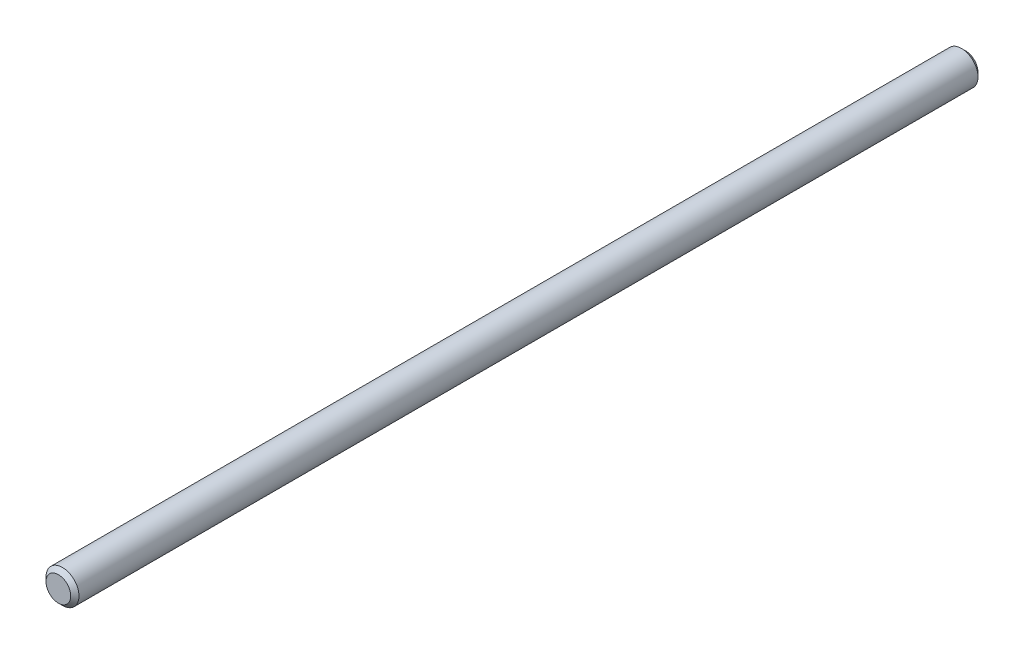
ISO-10303-21;
HEADER;
FILE_DESCRIPTION(('STEP AP214'),'2;1');
FILE_NAME('part.step','',(''),(''),'','','');
FILE_SCHEMA(('AUTOMOTIVE_DESIGN { 1 0 10303 214 1 1 1 1 }'));
ENDSEC;
DATA;
#1=APPLICATION_CONTEXT('core data for automotive mechanical design processes');
#2=APPLICATION_PROTOCOL_DEFINITION('international standard','automotive_design',2000,#1);
#3=PRODUCT_CONTEXT('',#1,'mechanical');
#4=PRODUCT('Part','Part','',(#3));
#5=PRODUCT_RELATED_PRODUCT_CATEGORY('part','',(#4));
#6=PRODUCT_DEFINITION_FORMATION('','',#4);
#7=PRODUCT_DEFINITION_CONTEXT('part definition',#1,'design');
#8=PRODUCT_DEFINITION('design','',#6,#7);
#9=PRODUCT_DEFINITION_SHAPE('','',#8);
#10=(LENGTH_UNIT() NAMED_UNIT(*) SI_UNIT(.MILLI.,.METRE.));
#11=(NAMED_UNIT(*) PLANE_ANGLE_UNIT() SI_UNIT($,.RADIAN.));
#12=(NAMED_UNIT(*) SI_UNIT($,.STERADIAN.) SOLID_ANGLE_UNIT());
#13=UNCERTAINTY_MEASURE_WITH_UNIT(LENGTH_MEASURE(1.E-05),#10,'distance_accuracy_value','');
#14=(GEOMETRIC_REPRESENTATION_CONTEXT(3) GLOBAL_UNCERTAINTY_ASSIGNED_CONTEXT((#13)) GLOBAL_UNIT_ASSIGNED_CONTEXT((#10,
#11,#12)) REPRESENTATION_CONTEXT('',''));
#15=CARTESIAN_POINT('',(0.,0.,0.));
#16=DIRECTION('',(0.,0.,1.));
#17=DIRECTION('',(1.,0.,0.));
#18=AXIS2_PLACEMENT_3D('',#15,#16,#17);
#19=CARTESIAN_POINT('',(0.,0.,-110.));
#20=DIRECTION('',(0.,0.,1.));
#21=DIRECTION('',(1.,0.,0.));
#22=AXIS2_PLACEMENT_3D('',#19,#20,#21);
#23=CYLINDRICAL_SURFACE('',#22,2.);
#24=CARTESIAN_POINT('',(0.,0.,-109.5));
#25=DIRECTION('',(0.,0.,1.));
#26=DIRECTION('',(1.,0.,0.));
#27=AXIS2_PLACEMENT_3D('',#24,#25,#26);
#28=CIRCLE('',#27,2.);
#29=CARTESIAN_POINT('',(2.,0.,-109.5));
#30=VERTEX_POINT('',#29);
#31=EDGE_CURVE('E50',#30,#30,#28,.T.);
#32=ORIENTED_EDGE('',*,*,#31,.T.);
#33=EDGE_LOOP('',(#32));
#34=FACE_BOUND('',#33,.T.);
#35=CARTESIAN_POINT('',(0.,0.,-0.5));
#36=DIRECTION('',(0.,0.,1.));
#37=DIRECTION('',(1.,0.,0.));
#38=AXIS2_PLACEMENT_3D('',#35,#36,#37);
#39=CIRCLE('',#38,2.);
#40=CARTESIAN_POINT('',(2.,0.,-0.5));
#41=VERTEX_POINT('',#40);
#42=EDGE_CURVE('E56',#41,#41,#39,.F.);
#43=ORIENTED_EDGE('',*,*,#42,.T.);
#44=EDGE_LOOP('',(#43));
#45=FACE_BOUND('',#44,.T.);
#46=ADVANCED_FACE('F36',(#34,#45),#23,.T.);
#47=CARTESIAN_POINT('',(0.,0.,-110.));
#48=DIRECTION('',(0.,0.,1.));
#49=DIRECTION('',(1.,0.,0.));
#50=AXIS2_PLACEMENT_3D('',#47,#48,#49);
#51=PLANE('',#50);
#52=CARTESIAN_POINT('',(0.,0.,-110.));
#53=DIRECTION('',(0.,0.,1.));
#54=DIRECTION('',(1.,0.,0.));
#55=AXIS2_PLACEMENT_3D('',#52,#53,#54);
#56=CIRCLE('',#55,1.5);
#57=CARTESIAN_POINT('',(1.5,0.,-110.));
#58=VERTEX_POINT('',#57);
#59=EDGE_CURVE('E44',#58,#58,#56,.F.);
#60=ORIENTED_EDGE('',*,*,#59,.T.);
#61=EDGE_LOOP('',(#60));
#62=FACE_BOUND('',#61,.T.);
#63=ADVANCED_FACE('F74',(#62),#51,.F.);
#64=CARTESIAN_POINT('',(0.,0.,0.));
#65=DIRECTION('',(0.,0.,1.));
#66=DIRECTION('',(1.,0.,0.));
#67=AXIS2_PLACEMENT_3D('',#64,#65,#66);
#68=PLANE('',#67);
#69=CARTESIAN_POINT('',(0.,0.,0.));
#70=DIRECTION('',(0.,0.,1.));
#71=DIRECTION('',(1.,0.,0.));
#72=AXIS2_PLACEMENT_3D('',#69,#70,#71);
#73=CIRCLE('',#72,1.49999999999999);
#74=CARTESIAN_POINT('',(1.49999999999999,0.,0.));
#75=VERTEX_POINT('',#74);
#76=EDGE_CURVE('E10',#75,#75,#73,.T.);
#77=ORIENTED_EDGE('',*,*,#76,.T.);
#78=EDGE_LOOP('',(#77));
#79=FACE_BOUND('',#78,.T.);
#80=ADVANCED_FACE('F71',(#79),#68,.T.);
#81=CARTESIAN_POINT('',(0.,0.,-109.5));
#82=DIRECTION('',(0.,0.,1.));
#83=DIRECTION('',(1.,0.,0.));
#84=AXIS2_PLACEMENT_3D('',#81,#82,#83);
#85=CONICAL_SURFACE('',#84,2.,0.785398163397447);
#86=ORIENTED_EDGE('',*,*,#59,.F.);
#87=EDGE_LOOP('',(#86));
#88=FACE_BOUND('',#87,.T.);
#89=ORIENTED_EDGE('',*,*,#31,.F.);
#90=EDGE_LOOP('',(#89));
#91=FACE_BOUND('',#90,.T.);
#92=ADVANCED_FACE('F67',(#88,#91),#85,.T.);
#93=CARTESIAN_POINT('',(0.,0.,0.));
#94=DIRECTION('',(0.,0.,-1.));
#95=DIRECTION('',(-1.,0.,0.));
#96=AXIS2_PLACEMENT_3D('',#93,#94,#95);
#97=CONICAL_SURFACE('',#96,1.49999999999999,0.78539816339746);
#98=ORIENTED_EDGE('',*,*,#42,.F.);
#99=EDGE_LOOP('',(#98));
#100=FACE_BOUND('',#99,.T.);
#101=ORIENTED_EDGE('',*,*,#76,.F.);
#102=EDGE_LOOP('',(#101));
#103=FACE_BOUND('',#102,.T.);
#104=ADVANCED_FACE('F38',(#100,#103),#97,.T.);
#105=CLOSED_SHELL('',(#46,#63,#80,#92,#104));
#106=MANIFOLD_SOLID_BREP('B2',#105);
#107=ADVANCED_BREP_SHAPE_REPRESENTATION('',(#18,#106),#14);
#108=SHAPE_DEFINITION_REPRESENTATION(#9,#107);
ENDSEC;
END-ISO-10303-21;
